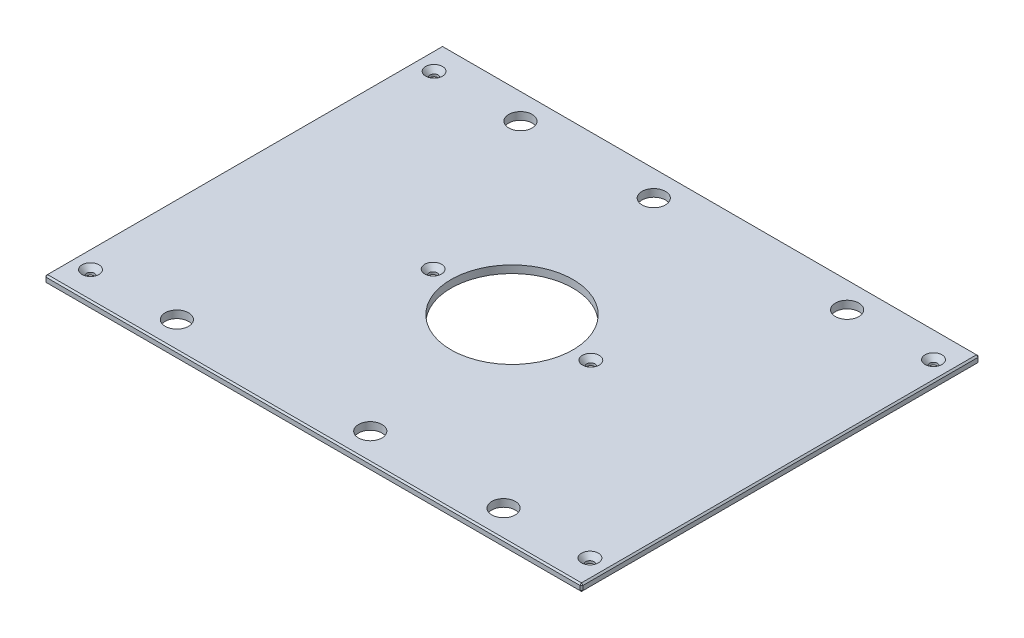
from build123d import *

# Parameters (mm, degrees)
SKETCH1_W                                     = 454.025
SKETCH1_H                                     = 336.55
BOSS_EXTRUDE1_DEPTH                           = 6.35
SKETCH13_R                                    = 51.562
CUT_EXTRUDE6_DEPTH                            = 283.650797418
F_25_32_0_78125_DIAMETER_HOLE1_D              = 19.84375
CHAMFER2_SIZE                                 = 1.27
CSK_FOR_1_4_FLAT_HEAD_MACHINE_SCREW1_AT_COUNT = 2
CSK_FOR_1_4_FLAT_HEAD_MACHINE_SCREW1_AT_PITCH = 290.50996
CSK_FOR_1_4_FLAT_HEAD_MACHINE_SCREW1_2_COUNT  = 2
CSK_FOR_1_4_FLAT_HEAD_MACHINE_SCREW1_2_PITCH  = 512.554594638
CSK_FOR_1_4_FLAT_HEAD_MACHINE_SCREW1_3_COUNT  = 2
CSK_FOR_1_4_FLAT_HEAD_MACHINE_SCREW1_3_PITCH  = 313.494488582
CSK_FOR_1_4_FLAT_HEAD_MACHINE_SCREW1_4_COUNT  = 2
CSK_FOR_1_4_FLAT_HEAD_MACHINE_SCREW1_4_PITCH  = 204.861961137
CSK_FOR_1_4_FLAT_HEAD_MACHINE_SCREW1_5_COUNT  = 2
CSK_FOR_1_4_FLAT_HEAD_MACHINE_SCREW1_5_PITCH  = 422.275
CSK_FOR_1_4_FLAT_HEAD_MACHINE_SCREW1_6_COUNT  = 2
CSK_FOR_1_4_FLAT_HEAD_MACHINE_SCREW1_6_PITCH  = 349.25
CSK_FOR_1_4_FLAT_HEAD_MACHINE_SCREW1_7_COUNT  = 2
CSK_FOR_1_4_FLAT_HEAD_MACHINE_SCREW1_7_PITCH  = 454.281409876


with BuildPart() as part:
    # Sketch1 → Boss-Extrude1 (new body)
    with BuildSketch(Plane(origin=(0, 0, 0), x_dir=(1, 0, 0), z_dir=(0, 1, 0))):
        Rectangle(SKETCH1_W, SKETCH1_H)
    extrude(amount=BOSS_EXTRUDE1_DEPTH)

    # Sketch13 → Cut-Extrude6 (cut, through all)
    with BuildSketch(Plane(origin=(0, 6.35, 0), x_dir=(1, 0, 0), z_dir=(0, 1, 0))):
        with Locations(Location((0, 0, 0), (0, 0, 270))):
            Circle(SKETCH13_R)
    extrude(amount=-CUT_EXTRUDE6_DEPTH, mode=Mode.SUBTRACT)

    # 25_32 _0.78125_ Diameter Hole1 (through all)
    with Locations(Plane(origin=(0, 6.35, 0), x_dir=(1, 0, 0), z_dir=(0, 1, 0))):
        with Locations((138.1125, 145.25498), (-138.1125, 145.25498), (138.1125, -145.25498), (-138.1125, -145.25498), (-25.4, 145.25498), (25.4, -145.25498)):
            Hole(F_25_32_0_78125_DIAMETER_HOLE1_D / 2)

    # Chamfer2
    chamfer2_edges = [part.edges().sort_by_distance(p)[0] for p in [
        (227.0125, 6.35, 0),
        (0, 6.35, -168.275),
        (-227.0125, 6.35, 0),
        (0, 0, -168.275),
        (227.0125, 0, 0),
        (0, 0, 168.275),
        (-227.0125, 0, 0),
        (0, 6.35, 168.275),
        (-227.0125, 3.175, -168.275),
        (227.0125, 3.175, -168.275),
        (227.0125, 3.175, 168.275),
        (-227.0125, 3.175, 168.275),
    ]]
    chamfer(chamfer2_edges, length=CHAMFER2_SIZE)

    # Sketch24 → CSK for 1_4 Flat Head Machine Screw1 (revolve, cut)
    with BuildSketch(Plane(origin=(211.1375, 6.35, -145.25498), x_dir=(0, 0, 1), z_dir=(1, 0, 0))):
        Polygon((0, 0), (0, 6.35), (3.3782, 6.35), (3.3782, 4.324464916), (7.1374, 0), align=None)
    csk_for_1_4_flat_head_machine_screw1 = revolve(axis=Axis((211.1375, 12.7, -145.25498), (0, -1, 0)), mode=Mode.SUBTRACT)

    # CSK for 1_4 Flat Head Machine Screw1 at: CSK for 1_4 Flat Head Machine Screw1 ×2
    with Locations(*[(0, 0, i * CSK_FOR_1_4_FLAT_HEAD_MACHINE_SCREW1_AT_PITCH) for i in range(1, CSK_FOR_1_4_FLAT_HEAD_MACHINE_SCREW1_AT_COUNT)]):
        add(csk_for_1_4_flat_head_machine_screw1, mode=Mode.SUBTRACT)

    # CSK for 1_4 Flat Head Machine Screw1 2: CSK for 1_4 Flat Head Machine Screw1 ×2
    with Locations(*[Vector(-0.8238634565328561, 0, 0.5667883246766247) * (i * CSK_FOR_1_4_FLAT_HEAD_MACHINE_SCREW1_2_PITCH) for i in range(1, CSK_FOR_1_4_FLAT_HEAD_MACHINE_SCREW1_2_COUNT)]):
        add(csk_for_1_4_flat_head_machine_screw1, mode=Mode.SUBTRACT)

    # CSK for 1_4 Flat Head Machine Screw1 3: CSK for 1_4 Flat Head Machine Screw1 ×2
    with Locations(*[Vector(-0.8861798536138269, 0, 0.46334141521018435) * (i * CSK_FOR_1_4_FLAT_HEAD_MACHINE_SCREW1_3_PITCH) for i in range(1, CSK_FOR_1_4_FLAT_HEAD_MACHINE_SCREW1_3_COUNT)]):
        add(csk_for_1_4_flat_head_machine_screw1, mode=Mode.SUBTRACT)

    # CSK for 1_4 Flat Head Machine Screw1 4: CSK for 1_4 Flat Head Machine Screw1 ×2
    with Locations(*[Vector(-0.7051699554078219, 0, 0.7090383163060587) * (i * CSK_FOR_1_4_FLAT_HEAD_MACHINE_SCREW1_4_PITCH) for i in range(1, CSK_FOR_1_4_FLAT_HEAD_MACHINE_SCREW1_4_COUNT)]):
        add(csk_for_1_4_flat_head_machine_screw1, mode=Mode.SUBTRACT)

    # CSK for 1_4 Flat Head Machine Screw1 5: CSK for 1_4 Flat Head Machine Screw1 ×2
    with Locations(*[(-i * CSK_FOR_1_4_FLAT_HEAD_MACHINE_SCREW1_5_PITCH, 0, 0) for i in range(1, CSK_FOR_1_4_FLAT_HEAD_MACHINE_SCREW1_5_COUNT)]):
        add(csk_for_1_4_flat_head_machine_screw1, mode=Mode.SUBTRACT)

    # CSK for 1_4 Flat Head Machine Screw1 6: CSK for 1_4 Flat Head Machine Screw1 ×2
    with Locations(*[(-i * CSK_FOR_1_4_FLAT_HEAD_MACHINE_SCREW1_6_PITCH, 0, 0) for i in range(1, CSK_FOR_1_4_FLAT_HEAD_MACHINE_SCREW1_6_COUNT)]):
        add(csk_for_1_4_flat_head_machine_screw1, mode=Mode.SUBTRACT)

    # CSK for 1_4 Flat Head Machine Screw1 7: CSK for 1_4 Flat Head Machine Screw1 ×2
    with Locations(*[Vector(-0.7687965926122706, 0, 0.639493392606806) * (i * CSK_FOR_1_4_FLAT_HEAD_MACHINE_SCREW1_7_PITCH) for i in range(1, CSK_FOR_1_4_FLAT_HEAD_MACHINE_SCREW1_7_COUNT)]):
        add(csk_for_1_4_flat_head_machine_screw1, mode=Mode.SUBTRACT)


solid = part.part
